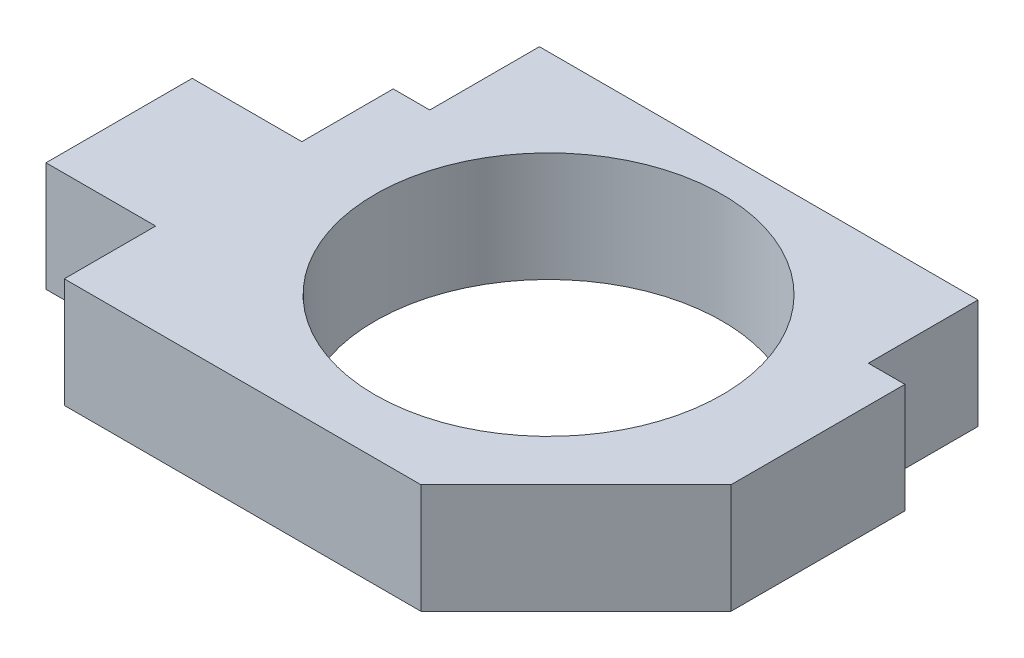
ISO-10303-21;
HEADER;
FILE_DESCRIPTION(('STEP AP214'),'2;1');
FILE_NAME('part.step','',(''),(''),'','','');
FILE_SCHEMA(('AUTOMOTIVE_DESIGN { 1 0 10303 214 1 1 1 1 }'));
ENDSEC;
DATA;
#1=APPLICATION_CONTEXT('core data for automotive mechanical design processes');
#2=APPLICATION_PROTOCOL_DEFINITION('international standard','automotive_design',2000,#1);
#3=PRODUCT_CONTEXT('',#1,'mechanical');
#4=PRODUCT('Part','Part','',(#3));
#5=PRODUCT_RELATED_PRODUCT_CATEGORY('part','',(#4));
#6=PRODUCT_DEFINITION_FORMATION('','',#4);
#7=PRODUCT_DEFINITION_CONTEXT('part definition',#1,'design');
#8=PRODUCT_DEFINITION('design','',#6,#7);
#9=PRODUCT_DEFINITION_SHAPE('','',#8);
#10=(LENGTH_UNIT() NAMED_UNIT(*) SI_UNIT(.MILLI.,.METRE.));
#11=(NAMED_UNIT(*) PLANE_ANGLE_UNIT() SI_UNIT($,.RADIAN.));
#12=(NAMED_UNIT(*) SI_UNIT($,.STERADIAN.) SOLID_ANGLE_UNIT());
#13=UNCERTAINTY_MEASURE_WITH_UNIT(LENGTH_MEASURE(1.E-05),#10,'distance_accuracy_value','');
#14=(GEOMETRIC_REPRESENTATION_CONTEXT(3) GLOBAL_UNCERTAINTY_ASSIGNED_CONTEXT((#13)) GLOBAL_UNIT_ASSIGNED_CONTEXT((#10,
#11,#12)) REPRESENTATION_CONTEXT('',''));
#15=CARTESIAN_POINT('',(0.,0.,0.));
#16=DIRECTION('',(0.,0.,1.));
#17=DIRECTION('',(1.,0.,0.));
#18=AXIS2_PLACEMENT_3D('',#15,#16,#17);
#19=CARTESIAN_POINT('',(-7.,3.,4.5));
#20=DIRECTION('',(0.,1.,0.));
#21=DIRECTION('',(0.,0.,1.));
#22=AXIS2_PLACEMENT_3D('',#19,#20,#21);
#23=PLANE('',#22);
#24=DIRECTION('',(0.,0.,1.));
#25=VECTOR('',#24,1.);
#26=CARTESIAN_POINT('',(-7.,3.,-4.5));
#27=LINE('',#26,#25);
#28=CARTESIAN_POINT('',(-7.,3.,-4.5));
#29=VERTEX_POINT('',#28);
#30=CARTESIAN_POINT('',(-7.,3.,-2.));
#31=VERTEX_POINT('',#30);
#32=EDGE_CURVE('E201',#29,#31,#27,.T.);
#33=ORIENTED_EDGE('',*,*,#32,.T.);
#34=DIRECTION('',(-1.,0.,0.));
#35=VECTOR('',#34,1.);
#36=CARTESIAN_POINT('',(-10.,3.,-2.));
#37=LINE('',#36,#35);
#38=CARTESIAN_POINT('',(-10.,3.,-2.));
#39=VERTEX_POINT('',#38);
#40=EDGE_CURVE('E167',#31,#39,#37,.T.);
#41=ORIENTED_EDGE('',*,*,#40,.T.);
#42=DIRECTION('',(0.,0.,1.));
#43=VECTOR('',#42,1.);
#44=CARTESIAN_POINT('',(-10.,3.,-2.));
#45=LINE('',#44,#43);
#46=CARTESIAN_POINT('',(-10.,3.,2.));
#47=VERTEX_POINT('',#46);
#48=EDGE_CURVE('E164',#39,#47,#45,.T.);
#49=ORIENTED_EDGE('',*,*,#48,.T.);
#50=DIRECTION('',(1.,0.,0.));
#51=VECTOR('',#50,1.);
#52=CARTESIAN_POINT('',(-10.,3.,2.));
#53=LINE('',#52,#51);
#54=CARTESIAN_POINT('',(-7.,3.,2.));
#55=VERTEX_POINT('',#54);
#56=EDGE_CURVE('E166',#47,#55,#53,.T.);
#57=ORIENTED_EDGE('',*,*,#56,.T.);
#58=CARTESIAN_POINT('',(-7.,3.,4.5));
#59=VERTEX_POINT('',#58);
#60=EDGE_CURVE('E177',#55,#59,#27,.T.);
#61=ORIENTED_EDGE('',*,*,#60,.T.);
#62=DIRECTION('',(1.,0.,0.));
#63=VECTOR('',#62,1.);
#64=CARTESIAN_POINT('',(-7.,3.,4.5));
#65=LINE('',#64,#63);
#66=CARTESIAN_POINT('',(2.75735931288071,3.,4.5));
#67=VERTEX_POINT('',#66);
#68=EDGE_CURVE('E198',#59,#67,#65,.T.);
#69=ORIENTED_EDGE('',*,*,#68,.T.);
#70=DIRECTION('',(0.707106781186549,0.,-0.707106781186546));
#71=VECTOR('',#70,1.);
#72=CARTESIAN_POINT('',(7.,3.,0.257359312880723));
#73=LINE('',#72,#71);
#74=CARTESIAN_POINT('',(7.,3.,0.257359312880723));
#75=VERTEX_POINT('',#74);
#76=EDGE_CURVE('E257',#67,#75,#73,.T.);
#77=ORIENTED_EDGE('',*,*,#76,.T.);
#78=DIRECTION('',(0.,0.,-1.));
#79=VECTOR('',#78,1.);
#80=CARTESIAN_POINT('',(7.,3.,-4.5));
#81=LINE('',#80,#79);
#82=CARTESIAN_POINT('',(7.,3.,-4.5));
#83=VERTEX_POINT('',#82);
#84=EDGE_CURVE('E255',#75,#83,#81,.T.);
#85=ORIENTED_EDGE('',*,*,#84,.T.);
#86=DIRECTION('',(-1.,0.,0.));
#87=VECTOR('',#86,1.);
#88=CARTESIAN_POINT('',(-7.,3.,-4.5));
#89=LINE('',#88,#87);
#90=CARTESIAN_POINT('',(6.,3.,-4.5));
#91=VERTEX_POINT('',#90);
#92=EDGE_CURVE('E149',#83,#91,#89,.T.);
#93=ORIENTED_EDGE('',*,*,#92,.T.);
#94=DIRECTION('',(0.,0.,-1.));
#95=VECTOR('',#94,1.);
#96=CARTESIAN_POINT('',(6.,3.,-7.5));
#97=LINE('',#96,#95);
#98=CARTESIAN_POINT('',(6.,3.,-7.5));
#99=VERTEX_POINT('',#98);
#100=EDGE_CURVE('E143',#91,#99,#97,.T.);
#101=ORIENTED_EDGE('',*,*,#100,.T.);
#102=DIRECTION('',(-1.,0.,0.));
#103=VECTOR('',#102,1.);
#104=CARTESIAN_POINT('',(-6.,3.,-7.5));
#105=LINE('',#104,#103);
#106=CARTESIAN_POINT('',(-6.,3.,-7.5));
#107=VERTEX_POINT('',#106);
#108=EDGE_CURVE('E133',#99,#107,#105,.T.);
#109=ORIENTED_EDGE('',*,*,#108,.T.);
#110=DIRECTION('',(0.,0.,1.));
#111=VECTOR('',#110,1.);
#112=CARTESIAN_POINT('',(-6.,3.,-7.5));
#113=LINE('',#112,#111);
#114=CARTESIAN_POINT('',(-6.,3.,-4.5));
#115=VERTEX_POINT('',#114);
#116=EDGE_CURVE('E142',#107,#115,#113,.T.);
#117=ORIENTED_EDGE('',*,*,#116,.T.);
#118=EDGE_CURVE('E254',#115,#29,#89,.T.);
#119=ORIENTED_EDGE('',*,*,#118,.T.);
#120=EDGE_LOOP('',(#33,#41,#49,#57,#61,#69,#77,#85,#93,#101,#109,#117,#119));
#121=FACE_BOUND('',#120,.T.);
#122=CARTESIAN_POINT('',(0.,3.,-1.75));
#123=DIRECTION('',(0.,1.,0.));
#124=DIRECTION('',(0.,0.,1.));
#125=AXIS2_PLACEMENT_3D('',#122,#123,#124);
#126=CIRCLE('',#125,4.75);
#127=CARTESIAN_POINT('',(0.,3.,3.));
#128=VERTEX_POINT('',#127);
#129=EDGE_CURVE('E273',#128,#128,#126,.T.);
#130=ORIENTED_EDGE('',*,*,#129,.F.);
#131=EDGE_LOOP('',(#130));
#132=FACE_BOUND('',#131,.T.);
#133=ADVANCED_FACE('F32',(#121,#132),#23,.T.);
#134=CARTESIAN_POINT('',(-7.,0.,4.5));
#135=DIRECTION('',(0.,1.,0.));
#136=DIRECTION('',(0.,0.,1.));
#137=AXIS2_PLACEMENT_3D('',#134,#135,#136);
#138=PLANE('',#137);
#139=DIRECTION('',(0.,0.,1.));
#140=VECTOR('',#139,1.);
#141=CARTESIAN_POINT('',(-7.,0.,-4.5));
#142=LINE('',#141,#140);
#143=CARTESIAN_POINT('',(-7.,0.,-4.5));
#144=VERTEX_POINT('',#143);
#145=CARTESIAN_POINT('',(-7.,0.,-2.));
#146=VERTEX_POINT('',#145);
#147=EDGE_CURVE('E205',#144,#146,#142,.T.);
#148=ORIENTED_EDGE('',*,*,#147,.F.);
#149=DIRECTION('',(-1.,0.,0.));
#150=VECTOR('',#149,1.);
#151=CARTESIAN_POINT('',(-7.,0.,-4.5));
#152=LINE('',#151,#150);
#153=CARTESIAN_POINT('',(-6.,0.,-4.5));
#154=VERTEX_POINT('',#153);
#155=EDGE_CURVE('E218',#154,#144,#152,.T.);
#156=ORIENTED_EDGE('',*,*,#155,.F.);
#157=DIRECTION('',(0.,0.,1.));
#158=VECTOR('',#157,1.);
#159=CARTESIAN_POINT('',(-6.,0.,-7.5));
#160=LINE('',#159,#158);
#161=CARTESIAN_POINT('',(-6.,0.,-7.5));
#162=VERTEX_POINT('',#161);
#163=EDGE_CURVE('E49',#162,#154,#160,.T.);
#164=ORIENTED_EDGE('',*,*,#163,.F.);
#165=DIRECTION('',(-1.,0.,0.));
#166=VECTOR('',#165,1.);
#167=CARTESIAN_POINT('',(-6.,0.,-7.5));
#168=LINE('',#167,#166);
#169=CARTESIAN_POINT('',(6.,0.,-7.5));
#170=VERTEX_POINT('',#169);
#171=EDGE_CURVE('E266',#170,#162,#168,.T.);
#172=ORIENTED_EDGE('',*,*,#171,.F.);
#173=DIRECTION('',(0.,0.,-1.));
#174=VECTOR('',#173,1.);
#175=CARTESIAN_POINT('',(6.,0.,-7.5));
#176=LINE('',#175,#174);
#177=CARTESIAN_POINT('',(6.,0.,-4.5));
#178=VERTEX_POINT('',#177);
#179=EDGE_CURVE('E155',#178,#170,#176,.T.);
#180=ORIENTED_EDGE('',*,*,#179,.F.);
#181=CARTESIAN_POINT('',(7.,0.,-4.5));
#182=VERTEX_POINT('',#181);
#183=EDGE_CURVE('E227',#182,#178,#152,.T.);
#184=ORIENTED_EDGE('',*,*,#183,.F.);
#185=DIRECTION('',(0.,0.,-1.));
#186=VECTOR('',#185,1.);
#187=CARTESIAN_POINT('',(7.,0.,-4.5));
#188=LINE('',#187,#186);
#189=CARTESIAN_POINT('',(7.,0.,0.257359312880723));
#190=VERTEX_POINT('',#189);
#191=EDGE_CURVE('E216',#190,#182,#188,.T.);
#192=ORIENTED_EDGE('',*,*,#191,.F.);
#193=DIRECTION('',(0.707106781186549,0.,-0.707106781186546));
#194=VECTOR('',#193,1.);
#195=CARTESIAN_POINT('',(7.,0.,0.257359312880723));
#196=LINE('',#195,#194);
#197=CARTESIAN_POINT('',(2.75735931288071,0.,4.5));
#198=VERTEX_POINT('',#197);
#199=EDGE_CURVE('E214',#198,#190,#196,.T.);
#200=ORIENTED_EDGE('',*,*,#199,.F.);
#201=DIRECTION('',(1.,0.,0.));
#202=VECTOR('',#201,1.);
#203=CARTESIAN_POINT('',(-7.,0.,4.5));
#204=LINE('',#203,#202);
#205=CARTESIAN_POINT('',(-7.,0.,4.5));
#206=VERTEX_POINT('',#205);
#207=EDGE_CURVE('E211',#206,#198,#204,.T.);
#208=ORIENTED_EDGE('',*,*,#207,.F.);
#209=CARTESIAN_POINT('',(-7.,0.,2.));
#210=VERTEX_POINT('',#209);
#211=EDGE_CURVE('E192',#210,#206,#142,.T.);
#212=ORIENTED_EDGE('',*,*,#211,.F.);
#213=DIRECTION('',(1.,0.,0.));
#214=VECTOR('',#213,1.);
#215=CARTESIAN_POINT('',(-10.,0.,2.));
#216=LINE('',#215,#214);
#217=CARTESIAN_POINT('',(-10.,0.,2.));
#218=VERTEX_POINT('',#217);
#219=EDGE_CURVE('E57',#218,#210,#216,.T.);
#220=ORIENTED_EDGE('',*,*,#219,.F.);
#221=DIRECTION('',(0.,0.,1.));
#222=VECTOR('',#221,1.);
#223=CARTESIAN_POINT('',(-10.,0.,-2.));
#224=LINE('',#223,#222);
#225=CARTESIAN_POINT('',(-10.,0.,-2.));
#226=VERTEX_POINT('',#225);
#227=EDGE_CURVE('E158',#226,#218,#224,.T.);
#228=ORIENTED_EDGE('',*,*,#227,.F.);
#229=DIRECTION('',(-1.,0.,0.));
#230=VECTOR('',#229,1.);
#231=CARTESIAN_POINT('',(-10.,0.,-2.));
#232=LINE('',#231,#230);
#233=EDGE_CURVE('E156',#146,#226,#232,.T.);
#234=ORIENTED_EDGE('',*,*,#233,.F.);
#235=EDGE_LOOP('',(#148,#156,#164,#172,#180,#184,#192,#200,#208,#212,#220,#228,#234));
#236=FACE_BOUND('',#235,.T.);
#237=CARTESIAN_POINT('',(0.,0.,-1.75));
#238=DIRECTION('',(0.,1.,0.));
#239=DIRECTION('',(0.,0.,1.));
#240=AXIS2_PLACEMENT_3D('',#237,#238,#239);
#241=CIRCLE('',#240,4.75);
#242=CARTESIAN_POINT('',(0.,0.,3.));
#243=VERTEX_POINT('',#242);
#244=EDGE_CURVE('E275',#243,#243,#241,.T.);
#245=ORIENTED_EDGE('',*,*,#244,.T.);
#246=EDGE_LOOP('',(#245));
#247=FACE_BOUND('',#246,.T.);
#248=ADVANCED_FACE('F247',(#236,#247),#138,.F.);
#249=CARTESIAN_POINT('',(-7.,3.,-4.5));
#250=DIRECTION('',(0.,0.,1.));
#251=DIRECTION('',(1.,0.,0.));
#252=AXIS2_PLACEMENT_3D('',#249,#250,#251);
#253=PLANE('',#252);
#254=DIRECTION('',(0.,-1.,0.));
#255=VECTOR('',#254,1.);
#256=CARTESIAN_POINT('',(6.,3.,-4.5));
#257=LINE('',#256,#255);
#258=EDGE_CURVE('E260',#91,#178,#257,.T.);
#259=ORIENTED_EDGE('',*,*,#258,.F.);
#260=ORIENTED_EDGE('',*,*,#92,.F.);
#261=DIRECTION('',(0.,-1.,0.));
#262=VECTOR('',#261,1.);
#263=CARTESIAN_POINT('',(7.,3.,-4.5));
#264=LINE('',#263,#262);
#265=EDGE_CURVE('E246',#83,#182,#264,.T.);
#266=ORIENTED_EDGE('',*,*,#265,.T.);
#267=ORIENTED_EDGE('',*,*,#183,.T.);
#268=EDGE_LOOP('',(#259,#260,#266,#267));
#269=FACE_BOUND('',#268,.T.);
#270=ADVANCED_FACE('F296',(#269),#253,.F.);
#271=CARTESIAN_POINT('',(-7.,3.,-4.5));
#272=DIRECTION('',(1.,0.,0.));
#273=DIRECTION('',(0.,0.,-1.));
#274=AXIS2_PLACEMENT_3D('',#271,#272,#273);
#275=PLANE('',#274);
#276=DIRECTION('',(0.,-1.,0.));
#277=VECTOR('',#276,1.);
#278=CARTESIAN_POINT('',(-7.,3.,-2.));
#279=LINE('',#278,#277);
#280=EDGE_CURVE('E189',#31,#146,#279,.T.);
#281=ORIENTED_EDGE('',*,*,#280,.F.);
#282=ORIENTED_EDGE('',*,*,#32,.F.);
#283=DIRECTION('',(0.,-1.,0.));
#284=VECTOR('',#283,1.);
#285=CARTESIAN_POINT('',(-7.,3.,-4.5));
#286=LINE('',#285,#284);
#287=EDGE_CURVE('E221',#29,#144,#286,.T.);
#288=ORIENTED_EDGE('',*,*,#287,.T.);
#289=ORIENTED_EDGE('',*,*,#147,.T.);
#290=EDGE_LOOP('',(#281,#282,#288,#289));
#291=FACE_BOUND('',#290,.T.);
#292=ADVANCED_FACE('F245',(#291),#275,.F.);
#293=ORIENTED_EDGE('',*,*,#60,.F.);
#294=DIRECTION('',(0.,-1.,0.));
#295=VECTOR('',#294,1.);
#296=CARTESIAN_POINT('',(-7.,3.,2.));
#297=LINE('',#296,#295);
#298=EDGE_CURVE('E174',#55,#210,#297,.T.);
#299=ORIENTED_EDGE('',*,*,#298,.T.);
#300=ORIENTED_EDGE('',*,*,#211,.T.);
#301=DIRECTION('',(0.,-1.,0.));
#302=VECTOR('',#301,1.);
#303=CARTESIAN_POINT('',(-7.,3.,4.5));
#304=LINE('',#303,#302);
#305=EDGE_CURVE('E11',#59,#206,#304,.T.);
#306=ORIENTED_EDGE('',*,*,#305,.F.);
#307=EDGE_LOOP('',(#293,#299,#300,#306));
#308=FACE_BOUND('',#307,.T.);
#309=ADVANCED_FACE('F34',(#308),#275,.F.);
#310=CARTESIAN_POINT('',(-7.,3.,4.5));
#311=DIRECTION('',(0.,0.,-1.));
#312=DIRECTION('',(-1.,0.,0.));
#313=AXIS2_PLACEMENT_3D('',#310,#311,#312);
#314=PLANE('',#313);
#315=ORIENTED_EDGE('',*,*,#207,.T.);
#316=DIRECTION('',(0.,-1.,0.));
#317=VECTOR('',#316,1.);
#318=CARTESIAN_POINT('',(2.75735931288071,3.,4.5));
#319=LINE('',#318,#317);
#320=EDGE_CURVE('E41',#67,#198,#319,.T.);
#321=ORIENTED_EDGE('',*,*,#320,.F.);
#322=ORIENTED_EDGE('',*,*,#68,.F.);
#323=ORIENTED_EDGE('',*,*,#305,.T.);
#324=EDGE_LOOP('',(#315,#321,#322,#323));
#325=FACE_BOUND('',#324,.T.);
#326=ADVANCED_FACE('F309',(#325),#314,.F.);
#327=CARTESIAN_POINT('',(7.,3.,0.257359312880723));
#328=DIRECTION('',(-0.707106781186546,0.,-0.707106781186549));
#329=DIRECTION('',(-0.707106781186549,0.,0.707106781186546));
#330=AXIS2_PLACEMENT_3D('',#327,#328,#329);
#331=PLANE('',#330);
#332=ORIENTED_EDGE('',*,*,#199,.T.);
#333=DIRECTION('',(0.,-1.,0.));
#334=VECTOR('',#333,1.);
#335=CARTESIAN_POINT('',(7.,3.,0.257359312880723));
#336=LINE('',#335,#334);
#337=EDGE_CURVE('E327',#75,#190,#336,.T.);
#338=ORIENTED_EDGE('',*,*,#337,.F.);
#339=ORIENTED_EDGE('',*,*,#76,.F.);
#340=ORIENTED_EDGE('',*,*,#320,.T.);
#341=EDGE_LOOP('',(#332,#338,#339,#340));
#342=FACE_BOUND('',#341,.T.);
#343=ADVANCED_FACE('F306',(#342),#331,.F.);
#344=CARTESIAN_POINT('',(7.,3.,-4.5));
#345=DIRECTION('',(-1.,0.,0.));
#346=DIRECTION('',(0.,0.,1.));
#347=AXIS2_PLACEMENT_3D('',#344,#345,#346);
#348=PLANE('',#347);
#349=ORIENTED_EDGE('',*,*,#191,.T.);
#350=ORIENTED_EDGE('',*,*,#265,.F.);
#351=ORIENTED_EDGE('',*,*,#84,.F.);
#352=ORIENTED_EDGE('',*,*,#337,.T.);
#353=EDGE_LOOP('',(#349,#350,#351,#352));
#354=FACE_BOUND('',#353,.T.);
#355=ADVANCED_FACE('F303',(#354),#348,.F.);
#356=ORIENTED_EDGE('',*,*,#118,.F.);
#357=DIRECTION('',(0.,-1.,0.));
#358=VECTOR('',#357,1.);
#359=CARTESIAN_POINT('',(-6.,3.,-4.5));
#360=LINE('',#359,#358);
#361=EDGE_CURVE('E160',#115,#154,#360,.T.);
#362=ORIENTED_EDGE('',*,*,#361,.T.);
#363=ORIENTED_EDGE('',*,*,#155,.T.);
#364=ORIENTED_EDGE('',*,*,#287,.F.);
#365=EDGE_LOOP('',(#356,#362,#363,#364));
#366=FACE_BOUND('',#365,.T.);
#367=ADVANCED_FACE('F238',(#366),#253,.F.);
#368=CARTESIAN_POINT('',(-10.,3.,-2.));
#369=DIRECTION('',(0.,0.,1.));
#370=DIRECTION('',(1.,0.,0.));
#371=AXIS2_PLACEMENT_3D('',#368,#369,#370);
#372=PLANE('',#371);
#373=ORIENTED_EDGE('',*,*,#233,.T.);
#374=DIRECTION('',(0.,-1.,0.));
#375=VECTOR('',#374,1.);
#376=CARTESIAN_POINT('',(-10.,3.,-2.));
#377=LINE('',#376,#375);
#378=EDGE_CURVE('E193',#39,#226,#377,.T.);
#379=ORIENTED_EDGE('',*,*,#378,.F.);
#380=ORIENTED_EDGE('',*,*,#40,.F.);
#381=ORIENTED_EDGE('',*,*,#280,.T.);
#382=EDGE_LOOP('',(#373,#379,#380,#381));
#383=FACE_BOUND('',#382,.T.);
#384=ADVANCED_FACE('F253',(#383),#372,.F.);
#385=CARTESIAN_POINT('',(-10.,3.,-2.));
#386=DIRECTION('',(1.,0.,0.));
#387=DIRECTION('',(0.,0.,-1.));
#388=AXIS2_PLACEMENT_3D('',#385,#386,#387);
#389=PLANE('',#388);
#390=ORIENTED_EDGE('',*,*,#227,.T.);
#391=DIRECTION('',(0.,-1.,0.));
#392=VECTOR('',#391,1.);
#393=CARTESIAN_POINT('',(-10.,3.,2.));
#394=LINE('',#393,#392);
#395=EDGE_CURVE('E171',#47,#218,#394,.T.);
#396=ORIENTED_EDGE('',*,*,#395,.F.);
#397=ORIENTED_EDGE('',*,*,#48,.F.);
#398=ORIENTED_EDGE('',*,*,#378,.T.);
#399=EDGE_LOOP('',(#390,#396,#397,#398));
#400=FACE_BOUND('',#399,.T.);
#401=ADVANCED_FACE('F361',(#400),#389,.F.);
#402=CARTESIAN_POINT('',(-10.,3.,2.));
#403=DIRECTION('',(0.,0.,-1.));
#404=DIRECTION('',(-1.,0.,0.));
#405=AXIS2_PLACEMENT_3D('',#402,#403,#404);
#406=PLANE('',#405);
#407=ORIENTED_EDGE('',*,*,#219,.T.);
#408=ORIENTED_EDGE('',*,*,#298,.F.);
#409=ORIENTED_EDGE('',*,*,#56,.F.);
#410=ORIENTED_EDGE('',*,*,#395,.T.);
#411=EDGE_LOOP('',(#407,#408,#409,#410));
#412=FACE_BOUND('',#411,.T.);
#413=ADVANCED_FACE('F370',(#412),#406,.F.);
#414=CARTESIAN_POINT('',(6.,3.,-7.5));
#415=DIRECTION('',(-1.,0.,0.));
#416=DIRECTION('',(0.,0.,1.));
#417=AXIS2_PLACEMENT_3D('',#414,#415,#416);
#418=PLANE('',#417);
#419=ORIENTED_EDGE('',*,*,#179,.T.);
#420=DIRECTION('',(0.,-1.,0.));
#421=VECTOR('',#420,1.);
#422=CARTESIAN_POINT('',(6.,3.,-7.5));
#423=LINE('',#422,#421);
#424=EDGE_CURVE('E137',#99,#170,#423,.T.);
#425=ORIENTED_EDGE('',*,*,#424,.F.);
#426=ORIENTED_EDGE('',*,*,#100,.F.);
#427=ORIENTED_EDGE('',*,*,#258,.T.);
#428=EDGE_LOOP('',(#419,#425,#426,#427));
#429=FACE_BOUND('',#428,.T.);
#430=ADVANCED_FACE('F153',(#429),#418,.F.);
#431=CARTESIAN_POINT('',(-6.,3.,-7.5));
#432=DIRECTION('',(0.,0.,1.));
#433=DIRECTION('',(1.,0.,0.));
#434=AXIS2_PLACEMENT_3D('',#431,#432,#433);
#435=PLANE('',#434);
#436=ORIENTED_EDGE('',*,*,#171,.T.);
#437=DIRECTION('',(0.,-1.,0.));
#438=VECTOR('',#437,1.);
#439=CARTESIAN_POINT('',(-6.,3.,-7.5));
#440=LINE('',#439,#438);
#441=EDGE_CURVE('E139',#107,#162,#440,.T.);
#442=ORIENTED_EDGE('',*,*,#441,.F.);
#443=ORIENTED_EDGE('',*,*,#108,.F.);
#444=ORIENTED_EDGE('',*,*,#424,.T.);
#445=EDGE_LOOP('',(#436,#442,#443,#444));
#446=FACE_BOUND('',#445,.T.);
#447=ADVANCED_FACE('F135',(#446),#435,.F.);
#448=CARTESIAN_POINT('',(-6.,3.,-7.5));
#449=DIRECTION('',(1.,0.,0.));
#450=DIRECTION('',(0.,0.,-1.));
#451=AXIS2_PLACEMENT_3D('',#448,#449,#450);
#452=PLANE('',#451);
#453=ORIENTED_EDGE('',*,*,#163,.T.);
#454=ORIENTED_EDGE('',*,*,#361,.F.);
#455=ORIENTED_EDGE('',*,*,#116,.F.);
#456=ORIENTED_EDGE('',*,*,#441,.T.);
#457=EDGE_LOOP('',(#453,#454,#455,#456));
#458=FACE_BOUND('',#457,.T.);
#459=ADVANCED_FACE('F285',(#458),#452,.F.);
#460=CARTESIAN_POINT('',(0.,3.,-1.75));
#461=DIRECTION('',(0.,-1.,0.));
#462=DIRECTION('',(0.,0.,-1.));
#463=AXIS2_PLACEMENT_3D('',#460,#461,#462);
#464=CYLINDRICAL_SURFACE('',#463,4.75);
#465=ORIENTED_EDGE('',*,*,#129,.T.);
#466=EDGE_LOOP('',(#465));
#467=FACE_BOUND('',#466,.T.);
#468=ORIENTED_EDGE('',*,*,#244,.F.);
#469=EDGE_LOOP('',(#468));
#470=FACE_BOUND('',#469,.T.);
#471=ADVANCED_FACE('F283',(#467,#470),#464,.F.);
#472=CLOSED_SHELL('',(#133,#248,#270,#292,#309,#326,#343,#355,#367,#384,#401,#413,#430,#447,
#459,#471));
#473=MANIFOLD_SOLID_BREP('B2',#472);
#474=ADVANCED_BREP_SHAPE_REPRESENTATION('',(#18,#473),#14);
#475=SHAPE_DEFINITION_REPRESENTATION(#9,#474);
ENDSEC;
END-ISO-10303-21;
